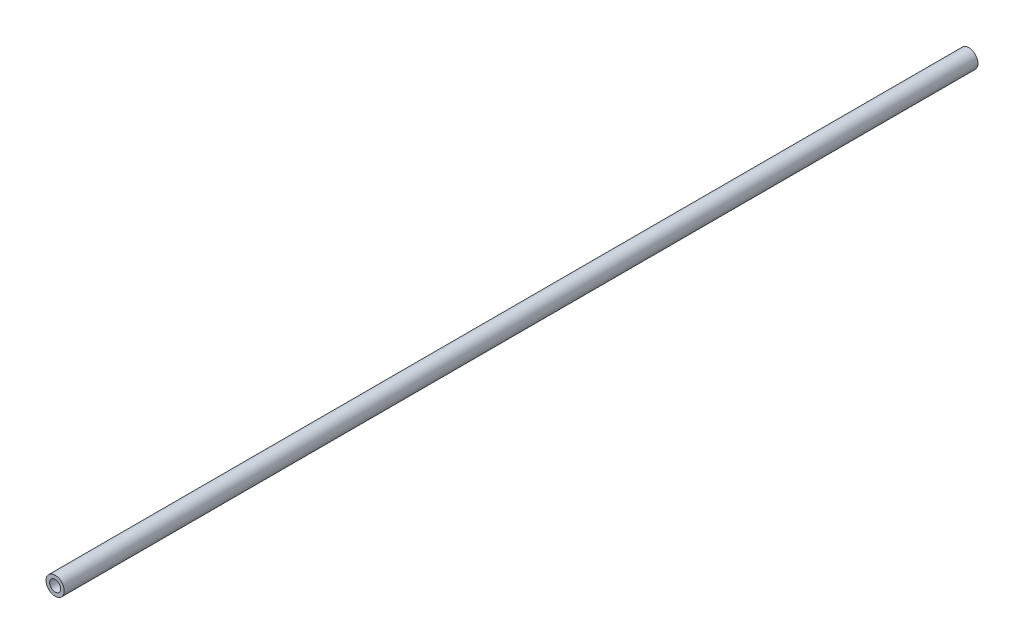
ISO-10303-21;
HEADER;
FILE_DESCRIPTION(('STEP AP214'),'2;1');
FILE_NAME('part.step','',(''),(''),'','','');
FILE_SCHEMA(('AUTOMOTIVE_DESIGN { 1 0 10303 214 1 1 1 1 }'));
ENDSEC;
DATA;
#1=APPLICATION_CONTEXT('core data for automotive mechanical design processes');
#2=APPLICATION_PROTOCOL_DEFINITION('international standard','automotive_design',2000,#1);
#3=PRODUCT_CONTEXT('',#1,'mechanical');
#4=PRODUCT('Part','Part','',(#3));
#5=PRODUCT_RELATED_PRODUCT_CATEGORY('part','',(#4));
#6=PRODUCT_DEFINITION_FORMATION('','',#4);
#7=PRODUCT_DEFINITION_CONTEXT('part definition',#1,'design');
#8=PRODUCT_DEFINITION('design','',#6,#7);
#9=PRODUCT_DEFINITION_SHAPE('','',#8);
#10=(LENGTH_UNIT() NAMED_UNIT(*) SI_UNIT(.MILLI.,.METRE.));
#11=(NAMED_UNIT(*) PLANE_ANGLE_UNIT() SI_UNIT($,.RADIAN.));
#12=(NAMED_UNIT(*) SI_UNIT($,.STERADIAN.) SOLID_ANGLE_UNIT());
#13=UNCERTAINTY_MEASURE_WITH_UNIT(LENGTH_MEASURE(1.E-05),#10,'distance_accuracy_value','');
#14=(GEOMETRIC_REPRESENTATION_CONTEXT(3) GLOBAL_UNCERTAINTY_ASSIGNED_CONTEXT((#13)) GLOBAL_UNIT_ASSIGNED_CONTEXT((#10,
#11,#12)) REPRESENTATION_CONTEXT('',''));
#15=CARTESIAN_POINT('',(0.,0.,0.));
#16=DIRECTION('',(0.,0.,1.));
#17=DIRECTION('',(1.,0.,0.));
#18=AXIS2_PLACEMENT_3D('',#15,#16,#17);
#19=CARTESIAN_POINT('',(0.,0.,0.));
#20=DIRECTION('',(0.,0.,1.));
#21=DIRECTION('',(1.,0.,0.));
#22=AXIS2_PLACEMENT_3D('',#19,#20,#21);
#23=PLANE('',#22);
#24=CARTESIAN_POINT('',(0.,0.,0.));
#25=DIRECTION('',(0.,0.,1.));
#26=DIRECTION('',(1.,0.,0.));
#27=AXIS2_PLACEMENT_3D('',#24,#25,#26);
#28=CIRCLE('',#27,6.);
#29=CARTESIAN_POINT('',(6.,0.,0.));
#30=VERTEX_POINT('',#29);
#31=EDGE_CURVE('E55',#30,#30,#28,.T.);
#32=ORIENTED_EDGE('',*,*,#31,.T.);
#33=EDGE_LOOP('',(#32));
#34=FACE_BOUND('',#33,.T.);
#35=CARTESIAN_POINT('',(0.,0.,0.));
#36=DIRECTION('',(0.,0.,1.));
#37=DIRECTION('',(1.,0.,0.));
#38=AXIS2_PLACEMENT_3D('',#35,#36,#37);
#39=CIRCLE('',#38,10.);
#40=CARTESIAN_POINT('',(10.,0.,0.));
#41=VERTEX_POINT('',#40);
#42=EDGE_CURVE('E47',#41,#41,#39,.T.);
#43=ORIENTED_EDGE('',*,*,#42,.F.);
#44=EDGE_LOOP('',(#43));
#45=FACE_BOUND('',#44,.T.);
#46=ADVANCED_FACE('F41',(#34,#45),#23,.F.);
#47=CARTESIAN_POINT('',(0.,-1.22464679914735E-13,1000.));
#48=DIRECTION('',(0.,0.,1.));
#49=DIRECTION('',(1.,0.,0.));
#50=AXIS2_PLACEMENT_3D('',#47,#48,#49);
#51=PLANE('',#50);
#52=CARTESIAN_POINT('',(0.,-1.22464679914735E-13,1000.));
#53=DIRECTION('',(0.,0.,1.));
#54=DIRECTION('',(1.,0.,0.));
#55=AXIS2_PLACEMENT_3D('',#52,#53,#54);
#56=CIRCLE('',#55,6.);
#57=CARTESIAN_POINT('',(6.,-1.22464679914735E-13,1000.));
#58=VERTEX_POINT('',#57);
#59=EDGE_CURVE('E51',#58,#58,#56,.T.);
#60=ORIENTED_EDGE('',*,*,#59,.F.);
#61=EDGE_LOOP('',(#60));
#62=FACE_BOUND('',#61,.T.);
#63=CARTESIAN_POINT('',(0.,-1.22464679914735E-13,1000.));
#64=DIRECTION('',(0.,0.,1.));
#65=DIRECTION('',(1.,0.,0.));
#66=AXIS2_PLACEMENT_3D('',#63,#64,#65);
#67=CIRCLE('',#66,10.);
#68=CARTESIAN_POINT('',(10.,-1.22464679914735E-13,1000.));
#69=VERTEX_POINT('',#68);
#70=EDGE_CURVE('E12',#69,#69,#67,.T.);
#71=ORIENTED_EDGE('',*,*,#70,.T.);
#72=EDGE_LOOP('',(#71));
#73=FACE_BOUND('',#72,.T.);
#74=ADVANCED_FACE('F71',(#62,#73),#51,.T.);
#75=CARTESIAN_POINT('',(0.,0.,0.));
#76=DIRECTION('',(0.,0.,1.));
#77=DIRECTION('',(0.,-1.,0.));
#78=AXIS2_PLACEMENT_3D('',#75,#76,#77);
#79=CYLINDRICAL_SURFACE('',#78,10.);
#80=ORIENTED_EDGE('',*,*,#70,.F.);
#81=EDGE_LOOP('',(#80));
#82=FACE_BOUND('',#81,.T.);
#83=ORIENTED_EDGE('',*,*,#42,.T.);
#84=EDGE_LOOP('',(#83));
#85=FACE_BOUND('',#84,.T.);
#86=ADVANCED_FACE('F65',(#82,#85),#79,.T.);
#87=CARTESIAN_POINT('',(0.,0.,0.));
#88=DIRECTION('',(0.,0.,1.));
#89=DIRECTION('',(0.,-1.,0.));
#90=AXIS2_PLACEMENT_3D('',#87,#88,#89);
#91=CYLINDRICAL_SURFACE('',#90,6.);
#92=ORIENTED_EDGE('',*,*,#59,.T.);
#93=EDGE_LOOP('',(#92));
#94=FACE_BOUND('',#93,.T.);
#95=ORIENTED_EDGE('',*,*,#31,.F.);
#96=EDGE_LOOP('',(#95));
#97=FACE_BOUND('',#96,.T.);
#98=ADVANCED_FACE('F63',(#94,#97),#91,.F.);
#99=CLOSED_SHELL('',(#46,#74,#86,#98));
#100=MANIFOLD_SOLID_BREP('B2',#99);
#101=ADVANCED_BREP_SHAPE_REPRESENTATION('',(#18,#100),#14);
#102=SHAPE_DEFINITION_REPRESENTATION(#9,#101);
ENDSEC;
END-ISO-10303-21;
